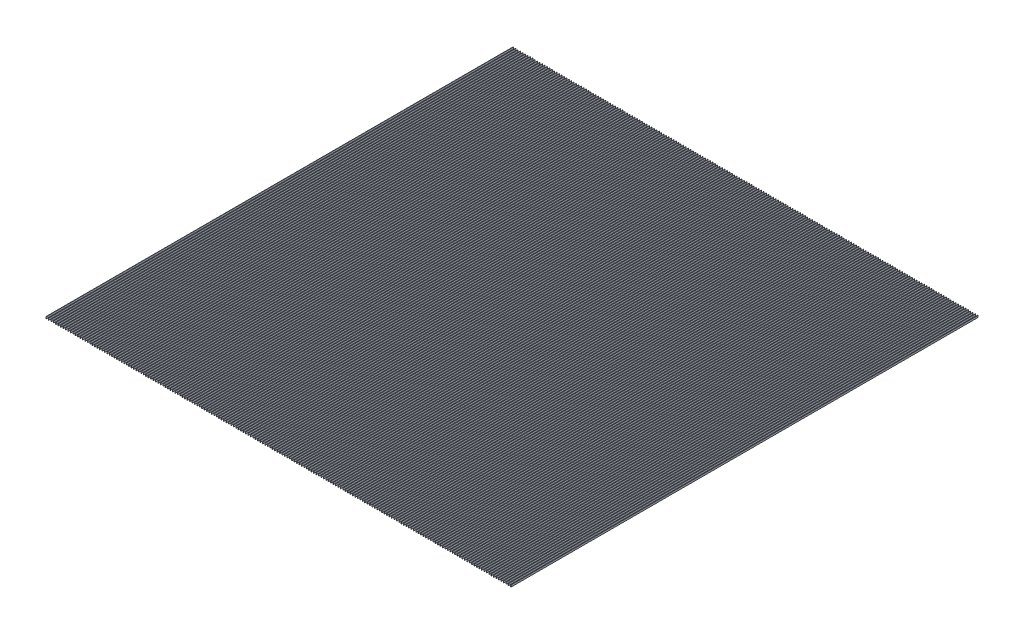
from build123d import *

# Parameters (mm, degrees)
SKETCH1_W           = 3.175
SKETCH1_H           = 6096
BOSS_EXTRUDE1_DEPTH = 25.4


with BuildPart() as part:
    # Sketch1 → Boss-Extrude1 (new body)
    with BuildSketch(Plane(origin=(0, 0, 0), x_dir=(1, 0, 0), z_dir=(0, 1, 0))):
        with Locations((31.75, 0)):
            Rectangle(SKETCH1_W, SKETCH1_H)
        Rectangle(SKETCH1_W, SKETCH1_H)
        with Locations((63.5, 0)):
            Rectangle(SKETCH1_W, SKETCH1_H)
        with Locations((95.25, 0)):
            Rectangle(SKETCH1_W, SKETCH1_H)
        with Locations((127, 0)):
            Rectangle(SKETCH1_W, SKETCH1_H)
        with Locations((158.75, 0)):
            Rectangle(SKETCH1_W, SKETCH1_H)
        with Locations((190.5, 0)):
            Rectangle(SKETCH1_W, SKETCH1_H)
        with Locations((222.25, 0)):
            Rectangle(SKETCH1_W, SKETCH1_H)
        with Locations((254, 0)):
            Rectangle(SKETCH1_W, SKETCH1_H)
        with Locations((285.75, 0)):
            Rectangle(SKETCH1_W, SKETCH1_H)
        with Locations((317.5, 0)):
            Rectangle(SKETCH1_W, SKETCH1_H)
        with Locations((349.25, 0)):
            Rectangle(SKETCH1_W, SKETCH1_H)
        with Locations((381, 0)):
            Rectangle(SKETCH1_W, SKETCH1_H)
        with Locations((412.75, 0)):
            Rectangle(SKETCH1_W, SKETCH1_H)
        with Locations((444.5, 0)):
            Rectangle(SKETCH1_W, SKETCH1_H)
        with Locations((476.25, 0)):
            Rectangle(SKETCH1_W, SKETCH1_H)
        with Locations((508, 0)):
            Rectangle(SKETCH1_W, SKETCH1_H)
        with Locations((539.75, 0)):
            Rectangle(SKETCH1_W, SKETCH1_H)
        with Locations((571.5, 0)):
            Rectangle(SKETCH1_W, SKETCH1_H)
        with Locations((603.25, 0)):
            Rectangle(SKETCH1_W, SKETCH1_H)
        with Locations((635, 0)):
            Rectangle(SKETCH1_W, SKETCH1_H)
        with Locations((666.75, 0)):
            Rectangle(SKETCH1_W, SKETCH1_H)
        with Locations((698.5, 0)):
            Rectangle(SKETCH1_W, SKETCH1_H)
        with Locations((730.25, 0)):
            Rectangle(SKETCH1_W, SKETCH1_H)
        with Locations((762, 0)):
            Rectangle(SKETCH1_W, SKETCH1_H)
        with Locations((793.75, 0)):
            Rectangle(SKETCH1_W, SKETCH1_H)
        with Locations((825.5, 0)):
            Rectangle(SKETCH1_W, SKETCH1_H)
        with Locations((857.25, 0)):
            Rectangle(SKETCH1_W, SKETCH1_H)
        with Locations((889, 0)):
            Rectangle(SKETCH1_W, SKETCH1_H)
        with Locations((920.75, 0)):
            Rectangle(SKETCH1_W, SKETCH1_H)
        with Locations((952.5, 0)):
            Rectangle(SKETCH1_W, SKETCH1_H)
        with Locations((984.25, 0)):
            Rectangle(SKETCH1_W, SKETCH1_H)
        with Locations((1016, 0)):
            Rectangle(SKETCH1_W, SKETCH1_H)
        with Locations((1047.75, 0)):
            Rectangle(SKETCH1_W, SKETCH1_H)
        with Locations((1079.5, 0)):
            Rectangle(SKETCH1_W, SKETCH1_H)
        with Locations((1111.25, 0)):
            Rectangle(SKETCH1_W, SKETCH1_H)
        with Locations((1143, 0)):
            Rectangle(SKETCH1_W, SKETCH1_H)
        with Locations((1174.75, 0)):
            Rectangle(SKETCH1_W, SKETCH1_H)
        with Locations((1206.5, 0)):
            Rectangle(SKETCH1_W, SKETCH1_H)
        with Locations((1238.25, 0)):
            Rectangle(SKETCH1_W, SKETCH1_H)
        with Locations((1270, 0)):
            Rectangle(SKETCH1_W, SKETCH1_H)
        with Locations((1301.75, 0)):
            Rectangle(SKETCH1_W, SKETCH1_H)
        with Locations((1333.5, 0)):
            Rectangle(SKETCH1_W, SKETCH1_H)
        with Locations((1365.25, 0)):
            Rectangle(SKETCH1_W, SKETCH1_H)
        with Locations((1397, 0)):
            Rectangle(SKETCH1_W, SKETCH1_H)
        with Locations((1428.75, 0)):
            Rectangle(SKETCH1_W, SKETCH1_H)
        with Locations((1460.5, 0)):
            Rectangle(SKETCH1_W, SKETCH1_H)
        with Locations((1492.25, 0)):
            Rectangle(SKETCH1_W, SKETCH1_H)
        with Locations((1524, 0)):
            Rectangle(SKETCH1_W, SKETCH1_H)
        with Locations((1555.75, 0)):
            Rectangle(SKETCH1_W, SKETCH1_H)
        with Locations((1587.5, 0)):
            Rectangle(SKETCH1_W, SKETCH1_H)
        with Locations((1619.25, 0)):
            Rectangle(SKETCH1_W, SKETCH1_H)
        with Locations((1651, 0)):
            Rectangle(SKETCH1_W, SKETCH1_H)
        with Locations((1682.75, 0)):
            Rectangle(SKETCH1_W, SKETCH1_H)
        with Locations((1714.5, 0)):
            Rectangle(SKETCH1_W, SKETCH1_H)
        with Locations((1746.25, 0)):
            Rectangle(SKETCH1_W, SKETCH1_H)
        with Locations((1778, 0)):
            Rectangle(SKETCH1_W, SKETCH1_H)
        with Locations((1809.75, 0)):
            Rectangle(SKETCH1_W, SKETCH1_H)
        with Locations((1841.5, 0)):
            Rectangle(SKETCH1_W, SKETCH1_H)
        with Locations((1873.25, 0)):
            Rectangle(SKETCH1_W, SKETCH1_H)
        with Locations((1905, 0)):
            Rectangle(SKETCH1_W, SKETCH1_H)
        with Locations((1936.75, 0)):
            Rectangle(SKETCH1_W, SKETCH1_H)
        with Locations((1968.5, 0)):
            Rectangle(SKETCH1_W, SKETCH1_H)
        with Locations((2000.25, 0)):
            Rectangle(SKETCH1_W, SKETCH1_H)
        with Locations((2032, 0)):
            Rectangle(SKETCH1_W, SKETCH1_H)
        with Locations((2063.75, 0)):
            Rectangle(SKETCH1_W, SKETCH1_H)
        with Locations((2095.5, 0)):
            Rectangle(SKETCH1_W, SKETCH1_H)
        with Locations((2127.25, 0)):
            Rectangle(SKETCH1_W, SKETCH1_H)
        with Locations((2159, 0)):
            Rectangle(SKETCH1_W, SKETCH1_H)
        with Locations((2190.75, 0)):
            Rectangle(SKETCH1_W, SKETCH1_H)
        with Locations((2222.5, 0)):
            Rectangle(SKETCH1_W, SKETCH1_H)
        with Locations((2254.25, 0)):
            Rectangle(SKETCH1_W, SKETCH1_H)
        with Locations((2286, 0)):
            Rectangle(SKETCH1_W, SKETCH1_H)
        with Locations((2317.75, 0)):
            Rectangle(SKETCH1_W, SKETCH1_H)
        with Locations((2349.5, 0)):
            Rectangle(SKETCH1_W, SKETCH1_H)
        with Locations((2381.25, 0)):
            Rectangle(SKETCH1_W, SKETCH1_H)
        with Locations((2413, 0)):
            Rectangle(SKETCH1_W, SKETCH1_H)
        with Locations((2444.75, 0)):
            Rectangle(SKETCH1_W, SKETCH1_H)
        with Locations((2476.5, 0)):
            Rectangle(SKETCH1_W, SKETCH1_H)
        with Locations((2508.25, 0)):
            Rectangle(SKETCH1_W, SKETCH1_H)
        with Locations((2540, 0)):
            Rectangle(SKETCH1_W, SKETCH1_H)
        with Locations((2571.75, 0)):
            Rectangle(SKETCH1_W, SKETCH1_H)
        with Locations((2603.5, 0)):
            Rectangle(SKETCH1_W, SKETCH1_H)
        with Locations((2635.25, 0)):
            Rectangle(SKETCH1_W, SKETCH1_H)
        with Locations((2667, 0)):
            Rectangle(SKETCH1_W, SKETCH1_H)
        with Locations((2698.75, 0)):
            Rectangle(SKETCH1_W, SKETCH1_H)
        with Locations((2730.5, 0)):
            Rectangle(SKETCH1_W, SKETCH1_H)
        with Locations((2762.25, 0)):
            Rectangle(SKETCH1_W, SKETCH1_H)
        with Locations((2794, 0)):
            Rectangle(SKETCH1_W, SKETCH1_H)
        with Locations((2825.75, 0)):
            Rectangle(SKETCH1_W, SKETCH1_H)
        with Locations((2857.5, 0)):
            Rectangle(SKETCH1_W, SKETCH1_H)
        with Locations((2889.25, 0)):
            Rectangle(SKETCH1_W, SKETCH1_H)
        with Locations((2921, 0)):
            Rectangle(SKETCH1_W, SKETCH1_H)
        with Locations((2952.75, 0)):
            Rectangle(SKETCH1_W, SKETCH1_H)
        with Locations((2984.5, 0)):
            Rectangle(SKETCH1_W, SKETCH1_H)
        with Locations((3016.25, 0)):
            Rectangle(SKETCH1_W, SKETCH1_H)
        with Locations((3048, 0)):
            Rectangle(SKETCH1_W, SKETCH1_H)
        with Locations((3079.75, 0)):
            Rectangle(SKETCH1_W, SKETCH1_H)
        with Locations((3111.5, 0)):
            Rectangle(SKETCH1_W, SKETCH1_H)
        with Locations((3143.25, 0)):
            Rectangle(SKETCH1_W, SKETCH1_H)
        with Locations((3175, 0)):
            Rectangle(SKETCH1_W, SKETCH1_H)
        with Locations((3206.75, 0)):
            Rectangle(SKETCH1_W, SKETCH1_H)
        with Locations((3238.5, 0)):
            Rectangle(SKETCH1_W, SKETCH1_H)
        with Locations((3270.25, 0)):
            Rectangle(SKETCH1_W, SKETCH1_H)
        with Locations((3302, 0)):
            Rectangle(SKETCH1_W, SKETCH1_H)
        with Locations((3333.75, 0)):
            Rectangle(SKETCH1_W, SKETCH1_H)
        with Locations((3365.5, 0)):
            Rectangle(SKETCH1_W, SKETCH1_H)
        with Locations((3397.25, 0)):
            Rectangle(SKETCH1_W, SKETCH1_H)
        with Locations((3429, 0)):
            Rectangle(SKETCH1_W, SKETCH1_H)
        with Locations((3460.75, 0)):
            Rectangle(SKETCH1_W, SKETCH1_H)
        with Locations((3492.5, 0)):
            Rectangle(SKETCH1_W, SKETCH1_H)
        with Locations((3524.25, 0)):
            Rectangle(SKETCH1_W, SKETCH1_H)
        with Locations((3556, 0)):
            Rectangle(SKETCH1_W, SKETCH1_H)
        with Locations((3587.75, 0)):
            Rectangle(SKETCH1_W, SKETCH1_H)
        with Locations((3619.5, 0)):
            Rectangle(SKETCH1_W, SKETCH1_H)
        with Locations((3651.25, 0)):
            Rectangle(SKETCH1_W, SKETCH1_H)
        with Locations((3683, 0)):
            Rectangle(SKETCH1_W, SKETCH1_H)
        with Locations((3714.75, 0)):
            Rectangle(SKETCH1_W, SKETCH1_H)
        with Locations((3746.5, 0)):
            Rectangle(SKETCH1_W, SKETCH1_H)
        with Locations((3778.25, 0)):
            Rectangle(SKETCH1_W, SKETCH1_H)
        with Locations((3810, 0)):
            Rectangle(SKETCH1_W, SKETCH1_H)
        with Locations((3841.75, 0)):
            Rectangle(SKETCH1_W, SKETCH1_H)
        with Locations((3873.5, 0)):
            Rectangle(SKETCH1_W, SKETCH1_H)
        with Locations((3905.25, 0)):
            Rectangle(SKETCH1_W, SKETCH1_H)
        with Locations((3937, 0)):
            Rectangle(SKETCH1_W, SKETCH1_H)
        with Locations((3968.75, 0)):
            Rectangle(SKETCH1_W, SKETCH1_H)
        with Locations((4000.5, 0)):
            Rectangle(SKETCH1_W, SKETCH1_H)
        with Locations((4032.25, 0)):
            Rectangle(SKETCH1_W, SKETCH1_H)
        with Locations((4064, 0)):
            Rectangle(SKETCH1_W, SKETCH1_H)
        with Locations((4095.75, 0)):
            Rectangle(SKETCH1_W, SKETCH1_H)
        with Locations((4127.5, 0)):
            Rectangle(SKETCH1_W, SKETCH1_H)
        with Locations((4159.25, 0)):
            Rectangle(SKETCH1_W, SKETCH1_H)
        with Locations((4191, 0)):
            Rectangle(SKETCH1_W, SKETCH1_H)
        with Locations((4222.75, 0)):
            Rectangle(SKETCH1_W, SKETCH1_H)
        with Locations((4254.5, 0)):
            Rectangle(SKETCH1_W, SKETCH1_H)
        with Locations((4286.25, 0)):
            Rectangle(SKETCH1_W, SKETCH1_H)
        with Locations((4318, 0)):
            Rectangle(SKETCH1_W, SKETCH1_H)
        with Locations((4349.75, 0)):
            Rectangle(SKETCH1_W, SKETCH1_H)
        with Locations((4381.5, 0)):
            Rectangle(SKETCH1_W, SKETCH1_H)
        with Locations((4413.25, 0)):
            Rectangle(SKETCH1_W, SKETCH1_H)
        with Locations((4445, 0)):
            Rectangle(SKETCH1_W, SKETCH1_H)
        with Locations((4476.75, 0)):
            Rectangle(SKETCH1_W, SKETCH1_H)
        with Locations((4508.5, 0)):
            Rectangle(SKETCH1_W, SKETCH1_H)
        with Locations((4540.25, 0)):
            Rectangle(SKETCH1_W, SKETCH1_H)
        with Locations((4572, 0)):
            Rectangle(SKETCH1_W, SKETCH1_H)
        with Locations((4603.75, 0)):
            Rectangle(SKETCH1_W, SKETCH1_H)
        with Locations((4635.5, 0)):
            Rectangle(SKETCH1_W, SKETCH1_H)
        with Locations((4667.25, 0)):
            Rectangle(SKETCH1_W, SKETCH1_H)
        with Locations((4699, 0)):
            Rectangle(SKETCH1_W, SKETCH1_H)
        with Locations((4730.75, 0)):
            Rectangle(SKETCH1_W, SKETCH1_H)
        with Locations((4762.5, 0)):
            Rectangle(SKETCH1_W, SKETCH1_H)
        with Locations((4794.25, 0)):
            Rectangle(SKETCH1_W, SKETCH1_H)
        with Locations((4826, 0)):
            Rectangle(SKETCH1_W, SKETCH1_H)
        with Locations((4857.75, 0)):
            Rectangle(SKETCH1_W, SKETCH1_H)
        with Locations((4889.5, 0)):
            Rectangle(SKETCH1_W, SKETCH1_H)
        with Locations((4921.25, 0)):
            Rectangle(SKETCH1_W, SKETCH1_H)
        with Locations((4953, 0)):
            Rectangle(SKETCH1_W, SKETCH1_H)
        with Locations((4984.75, 0)):
            Rectangle(SKETCH1_W, SKETCH1_H)
        with Locations((5016.5, 0)):
            Rectangle(SKETCH1_W, SKETCH1_H)
        with Locations((5048.25, 0)):
            Rectangle(SKETCH1_W, SKETCH1_H)
        with Locations((5080, 0)):
            Rectangle(SKETCH1_W, SKETCH1_H)
        with Locations((5111.75, 0)):
            Rectangle(SKETCH1_W, SKETCH1_H)
        with Locations((5143.5, 0)):
            Rectangle(SKETCH1_W, SKETCH1_H)
        with Locations((5175.25, 0)):
            Rectangle(SKETCH1_W, SKETCH1_H)
        with Locations((5207, 0)):
            Rectangle(SKETCH1_W, SKETCH1_H)
        with Locations((5238.75, 0)):
            Rectangle(SKETCH1_W, SKETCH1_H)
        with Locations((5270.5, 0)):
            Rectangle(SKETCH1_W, SKETCH1_H)
        with Locations((5302.25, 0)):
            Rectangle(SKETCH1_W, SKETCH1_H)
        with Locations((5334, 0)):
            Rectangle(SKETCH1_W, SKETCH1_H)
        with Locations((5365.75, 0)):
            Rectangle(SKETCH1_W, SKETCH1_H)
        with Locations((5397.5, 0)):
            Rectangle(SKETCH1_W, SKETCH1_H)
        with Locations((5429.25, 0)):
            Rectangle(SKETCH1_W, SKETCH1_H)
        with Locations((5461, 0)):
            Rectangle(SKETCH1_W, SKETCH1_H)
        with Locations((5492.75, 0)):
            Rectangle(SKETCH1_W, SKETCH1_H)
        with Locations((5524.5, 0)):
            Rectangle(SKETCH1_W, SKETCH1_H)
        with Locations((5556.25, 0)):
            Rectangle(SKETCH1_W, SKETCH1_H)
        with Locations((5588, 0)):
            Rectangle(SKETCH1_W, SKETCH1_H)
        with Locations((5619.75, 0)):
            Rectangle(SKETCH1_W, SKETCH1_H)
        with Locations((5651.5, 0)):
            Rectangle(SKETCH1_W, SKETCH1_H)
        with Locations((5683.25, 0)):
            Rectangle(SKETCH1_W, SKETCH1_H)
        with Locations((5715, 0)):
            Rectangle(SKETCH1_W, SKETCH1_H)
        with Locations((5746.75, 0)):
            Rectangle(SKETCH1_W, SKETCH1_H)
        with Locations((5778.5, 0)):
            Rectangle(SKETCH1_W, SKETCH1_H)
        with Locations((5810.25, 0)):
            Rectangle(SKETCH1_W, SKETCH1_H)
        with Locations((5842, 0)):
            Rectangle(SKETCH1_W, SKETCH1_H)
        with Locations((5873.75, 0)):
            Rectangle(SKETCH1_W, SKETCH1_H)
        with Locations((5905.5, 0)):
            Rectangle(SKETCH1_W, SKETCH1_H)
        with Locations((5937.25, 0)):
            Rectangle(SKETCH1_W, SKETCH1_H)
        with Locations((5969, 0)):
            Rectangle(SKETCH1_W, SKETCH1_H)
        with Locations((6000.75, 0)):
            Rectangle(SKETCH1_W, SKETCH1_H)
        with Locations((6032.5, 0)):
            Rectangle(SKETCH1_W, SKETCH1_H)
        with Locations((6064.25, 0)):
            Rectangle(SKETCH1_W, SKETCH1_H)
    extrude(amount=BOSS_EXTRUDE1_DEPTH)


solid = part.part
